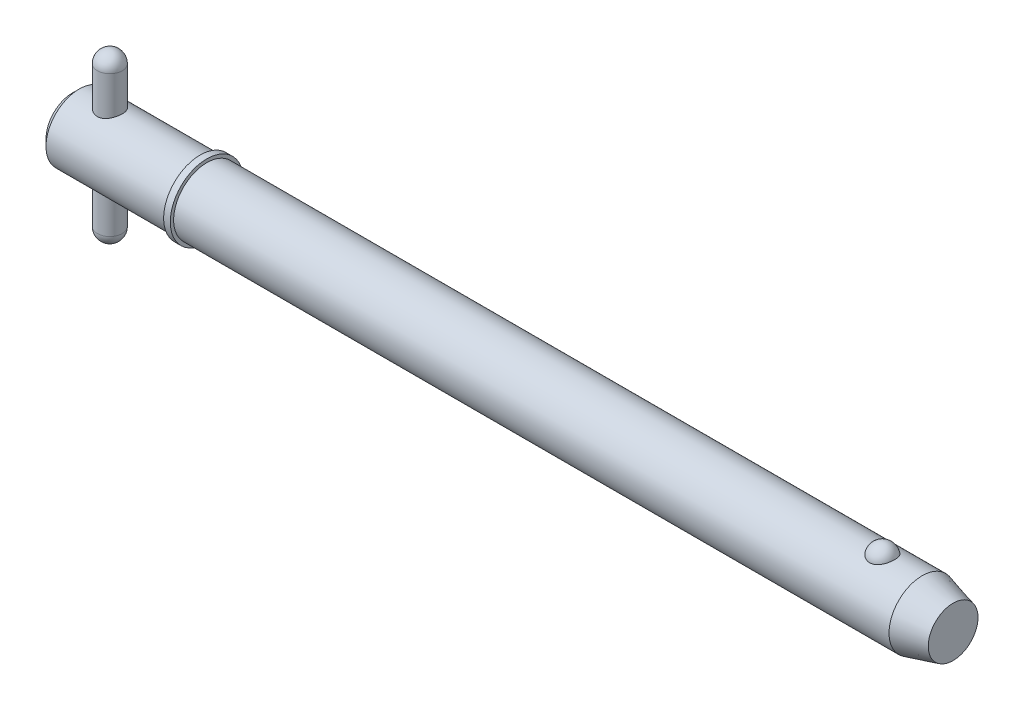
ISO-10303-21;
HEADER;
FILE_DESCRIPTION(('STEP AP214'),'2;1');
FILE_NAME('part.step','',(''),(''),'','','');
FILE_SCHEMA(('AUTOMOTIVE_DESIGN { 1 0 10303 214 1 1 1 1 }'));
ENDSEC;
DATA;
#1=APPLICATION_CONTEXT('core data for automotive mechanical design processes');
#2=APPLICATION_PROTOCOL_DEFINITION('international standard','automotive_design',2000,#1);
#3=PRODUCT_CONTEXT('',#1,'mechanical');
#4=PRODUCT('Part','Part','',(#3));
#5=PRODUCT_RELATED_PRODUCT_CATEGORY('part','',(#4));
#6=PRODUCT_DEFINITION_FORMATION('','',#4);
#7=PRODUCT_DEFINITION_CONTEXT('part definition',#1,'design');
#8=PRODUCT_DEFINITION('design','',#6,#7);
#9=PRODUCT_DEFINITION_SHAPE('','',#8);
#10=(LENGTH_UNIT() NAMED_UNIT(*) SI_UNIT(.MILLI.,.METRE.));
#11=(NAMED_UNIT(*) PLANE_ANGLE_UNIT() SI_UNIT($,.RADIAN.));
#12=(NAMED_UNIT(*) SI_UNIT($,.STERADIAN.) SOLID_ANGLE_UNIT());
#13=UNCERTAINTY_MEASURE_WITH_UNIT(LENGTH_MEASURE(1.E-05),#10,'distance_accuracy_value','');
#14=(GEOMETRIC_REPRESENTATION_CONTEXT(3) GLOBAL_UNCERTAINTY_ASSIGNED_CONTEXT((#13)) GLOBAL_UNIT_ASSIGNED_CONTEXT((#10,
#11,#12)) REPRESENTATION_CONTEXT('',''));
#15=CARTESIAN_POINT('',(0.,0.,0.));
#16=DIRECTION('',(0.,0.,1.));
#17=DIRECTION('',(1.,0.,0.));
#18=AXIS2_PLACEMENT_3D('',#15,#16,#17);
#19=CARTESIAN_POINT('',(7.14,15.875,0.));
#20=DIRECTION('',(0.,-1.,0.));
#21=DIRECTION('',(0.,0.,-1.));
#22=AXIS2_PLACEMENT_3D('',#19,#20,#21);
#23=CYLINDRICAL_SURFACE('',#22,2.38);
#24=CARTESIAN_POINT('',(7.14,-13.495,0.));
#25=DIRECTION('',(0.,-1.,0.));
#26=DIRECTION('',(0.,0.,-1.));
#27=AXIS2_PLACEMENT_3D('',#24,#25,#26);
#28=CIRCLE('',#27,2.38);
#29=CARTESIAN_POINT('',(7.14,-13.495,-2.38));
#30=VERTEX_POINT('',#29);
#31=EDGE_CURVE('P0_E10',#30,#30,#28,.F.);
#32=ORIENTED_EDGE('',*,*,#31,.T.);
#33=EDGE_LOOP('',(#32));
#34=FACE_BOUND('',#33,.T.);
#35=CARTESIAN_POINT('',(7.14,13.495,0.));
#36=DIRECTION('',(0.,-1.,0.));
#37=DIRECTION('',(0.,0.,-1.));
#38=AXIS2_PLACEMENT_3D('',#35,#36,#37);
#39=CIRCLE('',#38,2.38);
#40=CARTESIAN_POINT('',(7.14,13.495,-2.38));
#41=VERTEX_POINT('',#40);
#42=EDGE_CURVE('P0_E21',#41,#41,#39,.T.);
#43=ORIENTED_EDGE('',*,*,#42,.T.);
#44=EDGE_LOOP('',(#43));
#45=FACE_BOUND('',#44,.T.);
#46=ADVANCED_FACE('P0_F14',(#34,#45),#23,.T.);
#47=CARTESIAN_POINT('',(7.14,-13.495,0.));
#48=DIRECTION('',(0.,0.,1.));
#49=DIRECTION('',(1.,0.,0.));
#50=AXIS2_PLACEMENT_3D('',#47,#48,#49);
#51=SPHERICAL_SURFACE('',#50,2.38);
#52=CARTESIAN_POINT('',(7.14,-13.495,0.));
#53=DIRECTION('',(0.,-1.,0.));
#54=DIRECTION('',(0.,0.,-1.));
#55=AXIS2_PLACEMENT_3D('',#52,#53,#54);
#56=SPHERICAL_SURFACE('',#55,2.38);
#57=ORIENTED_EDGE('',*,*,#31,.F.);
#58=EDGE_LOOP('',(#57));
#59=FACE_BOUND('',#58,.T.);
#60=ADVANCED_FACE('P0_F29',(#59),#56,.T.);
#61=CARTESIAN_POINT('',(7.14,13.495,0.));
#62=DIRECTION('',(0.,0.,1.));
#63=DIRECTION('',(1.,0.,0.));
#64=AXIS2_PLACEMENT_3D('',#61,#62,#63);
#65=SPHERICAL_SURFACE('',#64,2.38);
#66=CARTESIAN_POINT('',(7.14,13.495,0.));
#67=DIRECTION('',(0.,-1.,0.));
#68=DIRECTION('',(0.,0.,-1.));
#69=AXIS2_PLACEMENT_3D('',#66,#67,#68);
#70=SPHERICAL_SURFACE('',#69,2.38);
#71=ORIENTED_EDGE('',*,*,#42,.F.);
#72=EDGE_LOOP('',(#71));
#73=FACE_BOUND('',#72,.T.);
#74=ADVANCED_FACE('P0_F16',(#73),#70,.T.);
#75=CLOSED_SHELL('',(#46,#60,#74));
#76=MANIFOLD_SOLID_BREP('P0_B1',#75);
#77=CARTESIAN_POINT('',(0.,0.,0.));
#78=DIRECTION('',(1.,0.,0.));
#79=DIRECTION('',(0.,0.,-1.));
#80=AXIS2_PLACEMENT_3D('',#77,#78,#79);
#81=CYLINDRICAL_SURFACE('',#80,6.35);
#82=CARTESIAN_POINT('',(162.655369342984,0.,0.));
#83=DIRECTION('',(1.,0.,0.));
#84=DIRECTION('',(0.,0.,-1.));
#85=AXIS2_PLACEMENT_3D('',#82,#83,#84);
#86=CIRCLE('',#85,6.35);
#87=CARTESIAN_POINT('',(162.655369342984,0.,-6.35));
#88=VERTEX_POINT('',#87);
#89=EDGE_CURVE('P1_E81',#88,#88,#86,.T.);
#90=ORIENTED_EDGE('',*,*,#89,.F.);
#91=EDGE_LOOP('',(#90));
#92=FACE_BOUND('',#91,.T.);
#93=CARTESIAN_POINT('',(25.7,0.,0.));
#94=DIRECTION('',(1.,0.,0.));
#95=DIRECTION('',(0.,0.,-1.));
#96=AXIS2_PLACEMENT_3D('',#93,#94,#95);
#97=CIRCLE('',#96,6.35);
#98=CARTESIAN_POINT('',(25.7,0.,-6.35));
#99=VERTEX_POINT('',#98);
#100=EDGE_CURVE('P1_E85',#99,#99,#97,.T.);
#101=ORIENTED_EDGE('',*,*,#100,.T.);
#102=EDGE_LOOP('',(#101));
#103=FACE_BOUND('',#102,.T.);
#104=CARTESIAN_POINT('',(155.030021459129,5.87502187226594,2.40969251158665));
#105=CARTESIAN_POINT('',(154.905030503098,5.87501645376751,2.40969773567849));
#106=CARTESIAN_POINT('',(154.780080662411,5.87916061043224,2.39967292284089));
#107=CARTESIAN_POINT('',(154.533909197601,5.89523112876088,2.35991730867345));
#108=CARTESIAN_POINT('',(154.412686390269,5.90715499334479,2.33019283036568));
#109=CARTESIAN_POINT('',(154.177517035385,5.93739567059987,2.25201402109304));
#110=CARTESIAN_POINT('',(154.063560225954,5.95570321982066,2.20358681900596));
#111=CARTESIAN_POINT('',(153.84557352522,5.99672067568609,2.08937987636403));
#112=CARTESIAN_POINT('',(153.741545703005,6.0194314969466,2.02359652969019));
#113=CARTESIAN_POINT('',(153.542943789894,6.06760647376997,1.87428969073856));
#114=CARTESIAN_POINT('',(153.448726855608,6.09313095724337,1.79031110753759));
#115=CARTESIAN_POINT('',(153.275255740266,6.14375873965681,1.6080017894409));
#116=CARTESIAN_POINT('',(153.196004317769,6.16886196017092,1.50966841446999));
#117=CARTESIAN_POINT('',(153.050845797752,6.21724600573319,1.29645884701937));
#118=CARTESIAN_POINT('',(152.985688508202,6.24039621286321,1.1810415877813));
#119=CARTESIAN_POINT('',(152.874703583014,6.28117277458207,0.940351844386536));
#120=CARTESIAN_POINT('',(152.828877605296,6.29879865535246,0.815078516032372));
#121=CARTESIAN_POINT('',(152.757023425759,6.32692073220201,0.556494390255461));
#122=CARTESIAN_POINT('',(152.731249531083,6.33732517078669,0.423102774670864));
#123=CARTESIAN_POINT('',(152.700988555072,6.34957673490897,0.153542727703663));
#124=CARTESIAN_POINT('',(152.696500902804,6.35142408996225,0.0173743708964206));
#125=CARTESIAN_POINT('',(152.708865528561,6.34638925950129,-0.253036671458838));
#126=CARTESIAN_POINT('',(152.725594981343,6.33955731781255,-0.387285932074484));
#127=CARTESIAN_POINT('',(152.779843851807,6.31794129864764,-0.650851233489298));
#128=CARTESIAN_POINT('',(152.817363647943,6.3031570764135,-0.780167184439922));
#129=CARTESIAN_POINT('',(152.912500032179,6.26711642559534,-1.03041949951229));
#130=CARTESIAN_POINT('',(152.970143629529,6.24585130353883,-1.15134433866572));
#131=CARTESIAN_POINT('',(153.104352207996,6.19905619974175,-1.38129800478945));
#132=CARTESIAN_POINT('',(153.180918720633,6.17352587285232,-1.49032586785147));
#133=CARTESIAN_POINT('',(153.351753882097,6.12080227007,-1.69393164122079));
#134=CARTESIAN_POINT('',(153.446100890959,6.09360200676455,-1.78844209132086));
#135=CARTESIAN_POINT('',(153.650119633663,6.04070434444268,-1.95970536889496));
#136=CARTESIAN_POINT('',(153.759790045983,6.015006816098,-2.0364597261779));
#137=CARTESIAN_POINT('',(153.989187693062,5.96867714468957,-2.16845644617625));
#138=CARTESIAN_POINT('',(154.108652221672,5.94794910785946,-2.22412062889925));
#139=CARTESIAN_POINT('',(154.356218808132,5.91340580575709,-2.31440992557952));
#140=CARTESIAN_POINT('',(154.484317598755,5.89958794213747,-2.34904294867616));
#141=CARTESIAN_POINT('',(154.738582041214,5.88111049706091,-2.39491590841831));
#142=CARTESIAN_POINT('',(154.864520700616,5.87602512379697,-2.40724512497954));
#143=CARTESIAN_POINT('',(155.116786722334,5.87428980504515,-2.41147867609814));
#144=CARTESIAN_POINT('',(155.243114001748,5.8776381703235,-2.40338710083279));
#145=CARTESIAN_POINT('',(155.488417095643,5.89212921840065,-2.36762715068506));
#146=CARTESIAN_POINT('',(155.607499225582,5.90302431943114,-2.3405803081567));
#147=CARTESIAN_POINT('',(155.83924472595,5.93113752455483,-2.26839066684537));
#148=CARTESIAN_POINT('',(155.951907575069,5.94835614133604,-2.22324640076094));
#149=CARTESIAN_POINT('',(156.170400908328,5.9877301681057,-2.11493806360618));
#150=CARTESIAN_POINT('',(156.276028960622,6.00998499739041,-2.05140269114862));
#151=CARTESIAN_POINT('',(156.475300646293,6.05690144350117,-1.90842705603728));
#152=CARTESIAN_POINT('',(156.568941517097,6.08156361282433,-1.82898313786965));
#153=CARTESIAN_POINT('',(156.746675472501,6.13211715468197,-1.65182429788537));
#154=CARTESIAN_POINT('',(156.830055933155,6.15800825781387,-1.5533938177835));
#155=CARTESIAN_POINT('',(156.979790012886,6.20712834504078,-1.34374214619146));
#156=CARTESIAN_POINT('',(157.046140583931,6.23035685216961,-1.23251867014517));
#157=CARTESIAN_POINT('',(157.162345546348,6.27251177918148,-0.996447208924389));
#158=CARTESIAN_POINT('',(157.211607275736,6.29127762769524,-0.871278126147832));
#159=CARTESIAN_POINT('',(157.289614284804,6.3215862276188,-0.613870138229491));
#160=CARTESIAN_POINT('',(157.318359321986,6.33312889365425,-0.481631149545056));
#161=CARTESIAN_POINT('',(157.354770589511,6.34782349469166,-0.213672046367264));
#162=CARTESIAN_POINT('',(157.362413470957,6.35096613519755,-0.0779482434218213));
#163=CARTESIAN_POINT('',(157.356395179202,6.34851322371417,0.192943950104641));
#164=CARTESIAN_POINT('',(157.342734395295,6.3429178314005,0.328112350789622));
#165=CARTESIAN_POINT('',(157.29450361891,6.32360512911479,0.593406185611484));
#166=CARTESIAN_POINT('',(157.260031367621,6.30992579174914,0.723552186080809));
#167=CARTESIAN_POINT('',(157.170953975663,6.27586325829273,0.97583417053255));
#168=CARTESIAN_POINT('',(157.11634761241,6.25547965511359,1.09796966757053));
#169=CARTESIAN_POINT('',(156.98775879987,6.20998183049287,1.33148921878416));
#170=CARTESIAN_POINT('',(156.913674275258,6.18484288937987,1.44281227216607));
#171=CARTESIAN_POINT('',(156.747820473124,6.13258735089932,1.65087683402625));
#172=CARTESIAN_POINT('',(156.656051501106,6.10547078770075,1.7476185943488));
#173=CARTESIAN_POINT('',(156.457183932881,6.05235879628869,1.92350926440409));
#174=CARTESIAN_POINT('',(156.350133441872,6.02636017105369,2.00271146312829));
#175=CARTESIAN_POINT('',(156.123138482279,5.97843747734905,2.14154159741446));
#176=CARTESIAN_POINT('',(156.003191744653,5.9565141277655,2.20116608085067));
#177=CARTESIAN_POINT('',(155.744523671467,5.91812106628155,2.30250570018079));
#178=CARTESIAN_POINT('',(155.60506980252,5.90217533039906,2.34256795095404));
#179=CARTESIAN_POINT('',(155.320397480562,5.88063128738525,2.3961521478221));
#180=CARTESIAN_POINT('',(155.17518174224,5.87502816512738,2.40968644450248));
#181=CARTESIAN_POINT('',(155.030021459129,5.87502187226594,2.40969251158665));
#182=B_SPLINE_CURVE_WITH_KNOTS('',3,(#104,#105,#106,#107,#108,#109,#110,#111,#112,#113,#114,
#115,#116,#117,#118,#119,#120,#121,#122,#123,#124,#125,#126,#127,#128,#129,#130,#131,#132,#133,
#134,#135,#136,#137,#138,#139,#140,#141,#142,#143,#144,#145,#146,#147,#148,#149,#150,#151,#152,
#153,#154,#155,#156,#157,#158,#159,#160,#161,#162,#163,#164,#165,#166,#167,#168,#169,#170,#171,
#172,#173,#174,#175,#176,#177,#178,#179,#180,#181),.UNSPECIFIED.,.T.,.F.,(4,2,2,2,2,2,2,2,2,2,2,
2,2,2,2,2,2,2,2,2,2,2,2,2,2,2,2,2,2,2,2,2,2,2,2,2,2,2,4),(0.,0.374440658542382,
0.748761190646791,1.122540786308,1.4963981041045,1.88098871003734,2.26565013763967,
2.66741104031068,3.06920639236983,3.47601794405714,3.88281858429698,4.28727498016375,
4.69173873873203,5.09674745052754,5.50178895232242,5.90865911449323,6.31549420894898,
6.71369855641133,7.11175305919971,7.48978077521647,7.86773278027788,8.23383886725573,
8.59997464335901,8.97409044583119,9.34829231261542,9.74122667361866,10.1342313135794,
10.5397522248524,10.9452779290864,11.3512521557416,11.75721896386,12.1612938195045,
12.5653932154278,12.9716540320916,13.3779078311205,13.7829098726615,14.1879832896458,
14.6230486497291,15.0579114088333),.UNSPECIFIED.);
#183=CARTESIAN_POINT('',(155.030021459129,5.87502187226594,2.40969251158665));
#184=VERTEX_POINT('',#183);
#185=EDGE_CURVE('P1_E35',#184,#184,#182,.T.);
#186=ORIENTED_EDGE('',*,*,#185,.T.);
#187=EDGE_LOOP('',(#186));
#188=FACE_BOUND('',#187,.T.);
#189=ADVANCED_FACE('P1_F13',(#92,#103,#188),#81,.T.);
#190=CARTESIAN_POINT('',(0.,0.,0.));
#191=DIRECTION('',(-1.,0.,0.));
#192=DIRECTION('',(0.,0.,1.));
#193=AXIS2_PLACEMENT_3D('',#190,#191,#192);
#194=PLANE('',#193);
#195=CARTESIAN_POINT('',(0.,0.,0.));
#196=DIRECTION('',(1.,0.,0.));
#197=DIRECTION('',(0.,0.,-1.));
#198=AXIS2_PLACEMENT_3D('',#195,#196,#197);
#199=CIRCLE('',#198,5.08);
#200=CARTESIAN_POINT('',(0.,0.,-5.08));
#201=VERTEX_POINT('',#200);
#202=EDGE_CURVE('P1_E9',#201,#201,#199,.T.);
#203=ORIENTED_EDGE('',*,*,#202,.F.);
#204=EDGE_LOOP('',(#203));
#205=FACE_BOUND('',#204,.T.);
#206=ADVANCED_FACE('P1_F15',(#205),#194,.T.);
#207=CARTESIAN_POINT('',(1.27,0.,0.));
#208=DIRECTION('',(1.,0.,0.));
#209=DIRECTION('',(0.,0.,-1.));
#210=AXIS2_PLACEMENT_3D('',#207,#208,#209);
#211=CONICAL_SURFACE('',#210,6.35,0.78539816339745);
#212=ORIENTED_EDGE('',*,*,#202,.T.);
#213=EDGE_LOOP('',(#212));
#214=FACE_BOUND('',#213,.T.);
#215=CARTESIAN_POINT('',(1.27,0.,0.));
#216=DIRECTION('',(1.,0.,0.));
#217=DIRECTION('',(0.,0.,-1.));
#218=AXIS2_PLACEMENT_3D('',#215,#216,#217);
#219=CIRCLE('',#218,6.35);
#220=CARTESIAN_POINT('',(1.27,0.,-6.35));
#221=VERTEX_POINT('',#220);
#222=EDGE_CURVE('P1_E26',#221,#221,#219,.T.);
#223=ORIENTED_EDGE('',*,*,#222,.F.);
#224=EDGE_LOOP('',(#223));
#225=FACE_BOUND('',#224,.T.);
#226=ADVANCED_FACE('P1_F77',(#214,#225),#211,.T.);
#227=CARTESIAN_POINT('',(0.,0.,0.));
#228=DIRECTION('',(1.,0.,0.));
#229=DIRECTION('',(0.,0.,-1.));
#230=AXIS2_PLACEMENT_3D('',#227,#228,#229);
#231=CYLINDRICAL_SURFACE('',#230,6.35);
#232=CARTESIAN_POINT('',(7.14,-5.88711304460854,2.38));
#233=CARTESIAN_POINT('',(7.01146258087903,-5.88710856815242,2.38000480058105));
#234=CARTESIAN_POINT('',(6.88295682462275,-5.89136840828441,2.36955244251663));
#235=CARTESIAN_POINT('',(6.62981934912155,-5.90782785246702,2.32820953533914));
#236=CARTESIAN_POINT('',(6.50518751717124,-5.92002722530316,2.29731958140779));
#237=CARTESIAN_POINT('',(6.26352403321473,-5.95079384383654,2.21639366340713));
#238=CARTESIAN_POINT('',(6.14647496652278,-5.96934583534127,2.16640353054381));
#239=CARTESIAN_POINT('',(5.92237941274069,-6.01070278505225,2.04885862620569));
#240=CARTESIAN_POINT('',(5.81533593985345,-6.03350901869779,1.98129858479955));
#241=CARTESIAN_POINT('',(5.60897525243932,-6.08207341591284,1.82693902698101));
#242=CARTESIAN_POINT('',(5.51022503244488,-6.10791836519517,1.73940861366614));
#243=CARTESIAN_POINT('',(5.32840561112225,-6.15892405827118,1.54914379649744));
#244=CARTESIAN_POINT('',(5.24533975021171,-6.1840846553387,1.44640616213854));
#245=CARTESIAN_POINT('',(5.09451639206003,-6.23191821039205,1.22434014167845));
#246=CARTESIAN_POINT('',(5.02737511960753,-6.25447755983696,1.10456656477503));
#247=CARTESIAN_POINT('',(4.91443001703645,-6.2935236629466,0.854429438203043));
#248=CARTESIAN_POINT('',(4.86861879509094,-6.31001251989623,0.724069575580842));
#249=CARTESIAN_POINT('',(4.80162253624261,-6.33444370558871,0.46242122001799));
#250=CARTESIAN_POINT('',(4.77946137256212,-6.34272370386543,0.331414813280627));
#251=CARTESIAN_POINT('',(4.75726677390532,-6.35101600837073,0.0672982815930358));
#252=CARTESIAN_POINT('',(4.75722615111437,-6.35103100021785,-0.0658111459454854));
#253=CARTESIAN_POINT('',(4.77870510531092,-6.3430064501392,-0.323358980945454));
#254=CARTESIAN_POINT('',(4.79915922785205,-6.33536494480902,-0.447900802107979));
#255=CARTESIAN_POINT('',(4.85925493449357,-6.31340794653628,-0.69163609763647));
#256=CARTESIAN_POINT('',(4.89889787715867,-6.29909198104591,-0.810829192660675));
#257=CARTESIAN_POINT('',(4.9967414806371,-6.26494471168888,-1.04254212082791));
#258=CARTESIAN_POINT('',(5.05520370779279,-6.24503620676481,-1.1549396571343));
#259=CARTESIAN_POINT('',(5.1887948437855,-6.20171869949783,-1.3686079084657));
#260=CARTESIAN_POINT('',(5.26392912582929,-6.17830856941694,-1.46987502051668));
#261=CARTESIAN_POINT('',(5.43386591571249,-6.12878580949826,-1.66468415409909));
#262=CARTESIAN_POINT('',(5.52956139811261,-6.10259519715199,-1.75742857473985));
#263=CARTESIAN_POINT('',(5.73530435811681,-6.05155777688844,-1.92585331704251));
#264=CARTESIAN_POINT('',(5.84535542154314,-6.02671130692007,-2.00152936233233));
#265=CARTESIAN_POINT('',(6.07982989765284,-5.98068420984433,-2.13519109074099));
#266=CARTESIAN_POINT('',(6.20451768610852,-5.95959698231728,-2.19274775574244));
#267=CARTESIAN_POINT('',(6.4628145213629,-5.92455622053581,-2.28574558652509));
#268=CARTESIAN_POINT('',(6.59641856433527,-5.91059872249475,-2.32119904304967));
#269=CARTESIAN_POINT('',(6.86087441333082,-5.8923327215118,-2.36717069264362));
#270=CARTESIAN_POINT('',(6.99147192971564,-5.8875347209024,-2.37895573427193));
#271=CARTESIAN_POINT('',(7.25283805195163,-5.88674545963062,-2.38091046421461));
#272=CARTESIAN_POINT('',(7.38360660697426,-5.89075200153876,-2.37108554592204));
#273=CARTESIAN_POINT('',(7.63510696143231,-5.90662331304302,-2.33124781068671));
#274=CARTESIAN_POINT('',(7.75602069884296,-5.91810660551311,-2.30221396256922));
#275=CARTESIAN_POINT('',(7.99120505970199,-5.94718527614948,-2.22601401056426));
#276=CARTESIAN_POINT('',(8.10547431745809,-5.96478190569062,-2.17884419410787));
#277=CARTESIAN_POINT('',(8.32888632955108,-6.00491533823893,-2.06572311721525));
#278=CARTESIAN_POINT('',(8.43767672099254,-6.02761250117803,-1.99913452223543));
#279=CARTESIAN_POINT('',(8.6429894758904,-6.07511988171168,-1.84974438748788));
#280=CARTESIAN_POINT('',(8.73950733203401,-6.09993087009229,-1.76693691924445));
#281=CARTESIAN_POINT('',(8.9238741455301,-6.1507686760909,-1.58125563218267));
#282=CARTESIAN_POINT('',(9.01078732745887,-6.17677301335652,-1.47744327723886));
#283=CARTESIAN_POINT('',(9.16607127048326,-6.22556172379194,-1.25606967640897));
#284=CARTESIAN_POINT('',(9.23444197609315,-6.24834608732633,-1.13850838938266));
#285=CARTESIAN_POINT('',(9.3502493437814,-6.28811144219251,-0.893050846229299));
#286=CARTESIAN_POINT('',(9.39775808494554,-6.30511236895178,-0.765192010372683));
#287=CARTESIAN_POINT('',(9.47032640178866,-6.33145833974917,-0.502514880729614));
#288=CARTESIAN_POINT('',(9.49539651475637,-6.34080697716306,-0.367699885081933));
#289=CARTESIAN_POINT('',(9.52124059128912,-6.35045496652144,-0.103396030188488));
#290=CARTESIAN_POINT('',(9.52334421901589,-6.35124952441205,0.025945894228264));
#291=CARTESIAN_POINT('',(9.50661518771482,-6.34499064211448,0.283061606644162));
#292=CARTESIAN_POINT('',(9.48778504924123,-6.33793814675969,0.410835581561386));
#293=CARTESIAN_POINT('',(9.43065630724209,-6.31700307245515,0.658028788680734));
#294=CARTESIAN_POINT('',(9.39284291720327,-6.30329098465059,0.7775756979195));
#295=CARTESIAN_POINT('',(9.29930406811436,-6.27046903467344,1.00863789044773));
#296=CARTESIAN_POINT('',(9.2435752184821,-6.25135815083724,1.12015164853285));
#297=CARTESIAN_POINT('',(9.11312349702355,-6.20865254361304,1.33711407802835));
#298=CARTESIAN_POINT('',(9.03770094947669,-6.18490316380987,1.44211105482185));
#299=CARTESIAN_POINT('',(8.87110640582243,-6.13583718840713,1.63836897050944));
#300=CARTESIAN_POINT('',(8.77992879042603,-6.11052003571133,1.72962498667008));
#301=CARTESIAN_POINT('',(8.57869799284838,-6.05953829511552,1.90076098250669));
#302=CARTESIAN_POINT('',(8.46790320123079,-6.03392573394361,1.97978778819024));
#303=CARTESIAN_POINT('',(8.23379693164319,-5.98676607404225,2.11813466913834));
#304=CARTESIAN_POINT('',(8.11048418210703,-5.9652193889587,2.17745273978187));
#305=CARTESIAN_POINT('',(7.84900037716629,-5.92818393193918,2.27641807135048));
#306=CARTESIAN_POINT('',(7.71041678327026,-5.91299857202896,2.31510015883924));
#307=CARTESIAN_POINT('',(7.42787316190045,-5.89246887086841,2.36688002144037));
#308=CARTESIAN_POINT('',(7.28391673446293,-5.88711805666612,2.37999462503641));
#309=CARTESIAN_POINT('',(7.14,-5.88711304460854,2.38));
#310=B_SPLINE_CURVE_WITH_KNOTS('',3,(#232,#233,#234,#235,#236,#237,#238,#239,#240,#241,#242,
#243,#244,#245,#246,#247,#248,#249,#250,#251,#252,#253,#254,#255,#256,#257,#258,#259,#260,#261,
#262,#263,#264,#265,#266,#267,#268,#269,#270,#271,#272,#273,#274,#275,#276,#277,#278,#279,#280,
#281,#282,#283,#284,#285,#286,#287,#288,#289,#290,#291,#292,#293,#294,#295,#296,#297,#298,#299,
#300,#301,#302,#303,#304,#305,#306,#307,#308,#309),.UNSPECIFIED.,.T.,.F.,(4,2,2,2,2,2,2,2,2,2,2,
2,2,2,2,2,2,2,2,2,2,2,2,2,2,2,2,2,2,2,2,2,2,2,2,2,2,2,4),(0.,0.385076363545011,
0.770141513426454,1.15428843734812,1.53855071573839,1.94016118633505,2.3418570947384,
2.75720522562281,3.1724093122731,3.569721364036,3.96690431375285,4.34445758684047,
4.72203759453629,5.10511017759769,5.48830640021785,5.89390240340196,6.29959991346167,
6.71428455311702,7.12873839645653,7.52034494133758,7.91185376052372,8.28480528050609,
8.65783318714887,9.0448340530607,9.43197664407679,9.84363087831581,10.2552863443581,
10.6655081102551,11.0755371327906,11.4616919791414,11.847800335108,12.224507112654,
12.6012852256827,12.9938941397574,13.386643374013,13.8000944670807,14.2135876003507,
14.6450218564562,15.0761720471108),.UNSPECIFIED.);
#311=CARTESIAN_POINT('',(7.14,-5.88711304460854,2.38));
#312=VERTEX_POINT('',#311);
#313=EDGE_CURVE('P1_E17',#312,#312,#310,.T.);
#314=ORIENTED_EDGE('',*,*,#313,.F.);
#315=EDGE_LOOP('',(#314));
#316=FACE_BOUND('',#315,.T.);
#317=CARTESIAN_POINT('',(7.14,5.88711304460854,2.38));
#318=CARTESIAN_POINT('',(7.26853741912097,5.88710856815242,2.38000480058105));
#319=CARTESIAN_POINT('',(7.39704317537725,5.89136840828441,2.36955244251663));
#320=CARTESIAN_POINT('',(7.65018065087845,5.90782785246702,2.32820953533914));
#321=CARTESIAN_POINT('',(7.77481248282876,5.92002722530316,2.29731958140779));
#322=CARTESIAN_POINT('',(8.01647596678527,5.95079384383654,2.21639366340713));
#323=CARTESIAN_POINT('',(8.13352503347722,5.96934583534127,2.16640353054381));
#324=CARTESIAN_POINT('',(8.35762058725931,6.01070278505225,2.04885862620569));
#325=CARTESIAN_POINT('',(8.46466406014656,6.03350901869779,1.98129858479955));
#326=CARTESIAN_POINT('',(8.67102474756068,6.08207341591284,1.82693902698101));
#327=CARTESIAN_POINT('',(8.76977496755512,6.10791836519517,1.73940861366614));
#328=CARTESIAN_POINT('',(8.95159438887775,6.15892405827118,1.54914379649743));
#329=CARTESIAN_POINT('',(9.03466024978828,6.1840846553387,1.44640616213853));
#330=CARTESIAN_POINT('',(9.18548360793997,6.23191821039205,1.22434014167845));
#331=CARTESIAN_POINT('',(9.25262488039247,6.25447755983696,1.10456656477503));
#332=CARTESIAN_POINT('',(9.36556998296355,6.2935236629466,0.854429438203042));
#333=CARTESIAN_POINT('',(9.41138120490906,6.31001251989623,0.72406957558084));
#334=CARTESIAN_POINT('',(9.47837746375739,6.33444370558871,0.462421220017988));
#335=CARTESIAN_POINT('',(9.50053862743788,6.34272370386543,0.331414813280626));
#336=CARTESIAN_POINT('',(9.52273322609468,6.35101600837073,0.0672982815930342));
#337=CARTESIAN_POINT('',(9.52277384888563,6.35103100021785,-0.0658111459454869));
#338=CARTESIAN_POINT('',(9.50129489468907,6.3430064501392,-0.323358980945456));
#339=CARTESIAN_POINT('',(9.48084077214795,6.33536494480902,-0.447900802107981));
#340=CARTESIAN_POINT('',(9.42074506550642,6.31340794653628,-0.691636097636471));
#341=CARTESIAN_POINT('',(9.38110212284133,6.29909198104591,-0.810829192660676));
#342=CARTESIAN_POINT('',(9.2832585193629,6.26494471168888,-1.04254212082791));
#343=CARTESIAN_POINT('',(9.22479629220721,6.24503620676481,-1.1549396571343));
#344=CARTESIAN_POINT('',(9.0912051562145,6.20171869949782,-1.3686079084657));
#345=CARTESIAN_POINT('',(9.0160708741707,6.17830856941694,-1.46987502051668));
#346=CARTESIAN_POINT('',(8.84613408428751,6.12878580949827,-1.66468415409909));
#347=CARTESIAN_POINT('',(8.75043860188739,6.10259519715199,-1.75742857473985));
#348=CARTESIAN_POINT('',(8.54469564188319,6.05155777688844,-1.92585331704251));
#349=CARTESIAN_POINT('',(8.43464457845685,6.02671130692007,-2.00152936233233));
#350=CARTESIAN_POINT('',(8.20017010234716,5.98068420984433,-2.13519109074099));
#351=CARTESIAN_POINT('',(8.07548231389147,5.95959698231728,-2.19274775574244));
#352=CARTESIAN_POINT('',(7.8171854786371,5.9245562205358,-2.28574558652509));
#353=CARTESIAN_POINT('',(7.68358143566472,5.91059872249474,-2.32119904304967));
#354=CARTESIAN_POINT('',(7.41912558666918,5.8923327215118,-2.36717069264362));
#355=CARTESIAN_POINT('',(7.28852807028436,5.8875347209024,-2.37895573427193));
#356=CARTESIAN_POINT('',(7.02716194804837,5.88674545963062,-2.38091046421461));
#357=CARTESIAN_POINT('',(6.89639339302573,5.89075200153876,-2.37108554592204));
#358=CARTESIAN_POINT('',(6.64489303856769,5.90662331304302,-2.33124781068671));
#359=CARTESIAN_POINT('',(6.52397930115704,5.91810660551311,-2.30221396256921));
#360=CARTESIAN_POINT('',(6.288794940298,5.94718527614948,-2.22601401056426));
#361=CARTESIAN_POINT('',(6.17452568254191,5.96478190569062,-2.17884419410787));
#362=CARTESIAN_POINT('',(5.95111367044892,6.00491533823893,-2.06572311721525));
#363=CARTESIAN_POINT('',(5.84232327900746,6.02761250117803,-1.99913452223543));
#364=CARTESIAN_POINT('',(5.6370105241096,6.07511988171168,-1.84974438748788));
#365=CARTESIAN_POINT('',(5.54049266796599,6.09993087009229,-1.76693691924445));
#366=CARTESIAN_POINT('',(5.3561258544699,6.1507686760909,-1.58125563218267));
#367=CARTESIAN_POINT('',(5.26921267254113,6.17677301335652,-1.47744327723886));
#368=CARTESIAN_POINT('',(5.11392872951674,6.22556172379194,-1.25606967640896));
#369=CARTESIAN_POINT('',(5.04555802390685,6.24834608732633,-1.13850838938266));
#370=CARTESIAN_POINT('',(4.9297506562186,6.28811144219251,-0.893050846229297));
#371=CARTESIAN_POINT('',(4.88224191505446,6.30511236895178,-0.76519201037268));
#372=CARTESIAN_POINT('',(4.80967359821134,6.33145833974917,-0.502514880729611));
#373=CARTESIAN_POINT('',(4.78460348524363,6.34080697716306,-0.36769988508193));
#374=CARTESIAN_POINT('',(4.75875940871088,6.35045496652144,-0.103396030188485));
#375=CARTESIAN_POINT('',(4.75665578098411,6.35124952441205,0.025945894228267));
#376=CARTESIAN_POINT('',(4.77338481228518,6.34499064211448,0.283061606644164));
#377=CARTESIAN_POINT('',(4.79221495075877,6.33793814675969,0.410835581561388));
#378=CARTESIAN_POINT('',(4.84934369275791,6.31700307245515,0.658028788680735));
#379=CARTESIAN_POINT('',(4.88715708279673,6.30329098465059,0.777575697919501));
#380=CARTESIAN_POINT('',(4.98069593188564,6.27046903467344,1.00863789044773));
#381=CARTESIAN_POINT('',(5.0364247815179,6.25135815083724,1.12015164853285));
#382=CARTESIAN_POINT('',(5.16687650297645,6.20865254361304,1.33711407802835));
#383=CARTESIAN_POINT('',(5.24229905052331,6.18490316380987,1.44211105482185));
#384=CARTESIAN_POINT('',(5.40889359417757,6.13583718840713,1.63836897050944));
#385=CARTESIAN_POINT('',(5.50007120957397,6.11052003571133,1.72962498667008));
#386=CARTESIAN_POINT('',(5.70130200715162,6.05953829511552,1.90076098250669));
#387=CARTESIAN_POINT('',(5.81209679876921,6.03392573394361,1.97978778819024));
#388=CARTESIAN_POINT('',(6.04620306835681,5.98676607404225,2.11813466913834));
#389=CARTESIAN_POINT('',(6.16951581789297,5.9652193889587,2.17745273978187));
#390=CARTESIAN_POINT('',(6.43099962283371,5.92818393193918,2.27641807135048));
#391=CARTESIAN_POINT('',(6.56958321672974,5.91299857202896,2.31510015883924));
#392=CARTESIAN_POINT('',(6.85212683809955,5.89246887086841,2.36688002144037));
#393=CARTESIAN_POINT('',(6.99608326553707,5.88711805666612,2.37999462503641));
#394=CARTESIAN_POINT('',(7.14,5.88711304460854,2.38));
#395=B_SPLINE_CURVE_WITH_KNOTS('',3,(#317,#318,#319,#320,#321,#322,#323,#324,#325,#326,#327,
#328,#329,#330,#331,#332,#333,#334,#335,#336,#337,#338,#339,#340,#341,#342,#343,#344,#345,#346,
#347,#348,#349,#350,#351,#352,#353,#354,#355,#356,#357,#358,#359,#360,#361,#362,#363,#364,#365,
#366,#367,#368,#369,#370,#371,#372,#373,#374,#375,#376,#377,#378,#379,#380,#381,#382,#383,#384,
#385,#386,#387,#388,#389,#390,#391,#392,#393,#394),.UNSPECIFIED.,.T.,.F.,(4,2,2,2,2,2,2,2,2,2,2,
2,2,2,2,2,2,2,2,2,2,2,2,2,2,2,2,2,2,2,2,2,2,2,2,2,2,2,4),(0.,0.385076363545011,
0.770141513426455,1.15428843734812,1.53855071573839,1.94016118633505,2.3418570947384,
2.75720522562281,3.1724093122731,3.56972136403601,3.96690431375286,4.34445758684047,
4.72203759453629,5.10511017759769,5.48830640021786,5.89390240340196,6.29959991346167,
6.71428455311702,7.12873839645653,7.52034494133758,7.91185376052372,8.2848052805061,
8.65783318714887,9.0448340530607,9.43197664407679,9.84363087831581,10.2552863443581,
10.6655081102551,11.0755371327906,11.4616919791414,11.847800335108,12.2245071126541,
12.6012852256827,12.9938941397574,13.386643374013,13.8000944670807,14.2135876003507,
14.6450218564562,15.0761720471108),.UNSPECIFIED.);
#396=CARTESIAN_POINT('',(7.14,5.88711304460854,2.38));
#397=VERTEX_POINT('',#396);
#398=EDGE_CURVE('P1_E43',#397,#397,#395,.T.);
#399=ORIENTED_EDGE('',*,*,#398,.F.);
#400=EDGE_LOOP('',(#399));
#401=FACE_BOUND('',#400,.T.);
#402=ORIENTED_EDGE('',*,*,#222,.T.);
#403=EDGE_LOOP('',(#402));
#404=FACE_BOUND('',#403,.T.);
#405=CARTESIAN_POINT('',(24.43,0.,0.));
#406=DIRECTION('',(1.,0.,0.));
#407=DIRECTION('',(0.,0.,-1.));
#408=AXIS2_PLACEMENT_3D('',#405,#406,#407);
#409=CIRCLE('',#408,6.35);
#410=CARTESIAN_POINT('',(24.43,0.,-6.35));
#411=VERTEX_POINT('',#410);
#412=EDGE_CURVE('P1_E31',#411,#411,#409,.T.);
#413=ORIENTED_EDGE('',*,*,#412,.F.);
#414=EDGE_LOOP('',(#413));
#415=FACE_BOUND('',#414,.T.);
#416=ADVANCED_FACE('P1_F103',(#316,#401,#404,#415),#231,.T.);
#417=CARTESIAN_POINT('',(24.43,6.35,0.));
#418=DIRECTION('',(-1.,0.,0.));
#419=DIRECTION('',(0.,0.,1.));
#420=AXIS2_PLACEMENT_3D('',#417,#418,#419);
#421=PLANE('',#420);
#422=ORIENTED_EDGE('',*,*,#412,.T.);
#423=EDGE_LOOP('',(#422));
#424=FACE_BOUND('',#423,.T.);
#425=CARTESIAN_POINT('',(24.43,0.,0.));
#426=DIRECTION('',(1.,0.,0.));
#427=DIRECTION('',(0.,0.,-1.));
#428=AXIS2_PLACEMENT_3D('',#425,#426,#427);
#429=CIRCLE('',#428,6.985);
#430=CARTESIAN_POINT('',(24.43,0.,-6.985));
#431=VERTEX_POINT('',#430);
#432=EDGE_CURVE('P1_E91',#431,#431,#429,.T.);
#433=ORIENTED_EDGE('',*,*,#432,.F.);
#434=EDGE_LOOP('',(#433));
#435=FACE_BOUND('',#434,.T.);
#436=ADVANCED_FACE('P1_F100',(#424,#435),#421,.T.);
#437=CARTESIAN_POINT('',(0.,0.,0.));
#438=DIRECTION('',(1.,0.,0.));
#439=DIRECTION('',(0.,0.,-1.));
#440=AXIS2_PLACEMENT_3D('',#437,#438,#439);
#441=CYLINDRICAL_SURFACE('',#440,6.985);
#442=ORIENTED_EDGE('',*,*,#432,.T.);
#443=EDGE_LOOP('',(#442));
#444=FACE_BOUND('',#443,.T.);
#445=CARTESIAN_POINT('',(25.7,0.,0.));
#446=DIRECTION('',(1.,0.,0.));
#447=DIRECTION('',(0.,0.,-1.));
#448=AXIS2_PLACEMENT_3D('',#445,#446,#447);
#449=CIRCLE('',#448,6.985);
#450=CARTESIAN_POINT('',(25.7,0.,-6.985));
#451=VERTEX_POINT('',#450);
#452=EDGE_CURVE('P1_E88',#451,#451,#449,.T.);
#453=ORIENTED_EDGE('',*,*,#452,.F.);
#454=EDGE_LOOP('',(#453));
#455=FACE_BOUND('',#454,.T.);
#456=ADVANCED_FACE('P1_F68',(#444,#455),#441,.T.);
#457=CARTESIAN_POINT('',(25.7,6.985,0.));
#458=DIRECTION('',(1.,0.,0.));
#459=DIRECTION('',(0.,0.,-1.));
#460=AXIS2_PLACEMENT_3D('',#457,#458,#459);
#461=PLANE('',#460);
#462=ORIENTED_EDGE('',*,*,#452,.T.);
#463=EDGE_LOOP('',(#462));
#464=FACE_BOUND('',#463,.T.);
#465=ORIENTED_EDGE('',*,*,#100,.F.);
#466=EDGE_LOOP('',(#465));
#467=FACE_BOUND('',#466,.T.);
#468=ADVANCED_FACE('P1_F62',(#464,#467),#461,.T.);
#469=CARTESIAN_POINT('',(168.58,0.,0.));
#470=DIRECTION('',(-1.,0.,0.));
#471=DIRECTION('',(0.,0.,1.));
#472=AXIS2_PLACEMENT_3D('',#469,#470,#471);
#473=CONICAL_SURFACE('',#472,4.76250000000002,0.26179938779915);
#474=ORIENTED_EDGE('',*,*,#89,.T.);
#475=EDGE_LOOP('',(#474));
#476=FACE_BOUND('',#475,.T.);
#477=CARTESIAN_POINT('',(168.58,0.,0.));
#478=DIRECTION('',(1.,0.,0.));
#479=DIRECTION('',(0.,0.,-1.));
#480=AXIS2_PLACEMENT_3D('',#477,#478,#479);
#481=CIRCLE('',#480,4.76250000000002);
#482=CARTESIAN_POINT('',(168.58,0.,-4.76250000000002));
#483=VERTEX_POINT('',#482);
#484=EDGE_CURVE('P1_E42',#483,#483,#481,.T.);
#485=ORIENTED_EDGE('',*,*,#484,.F.);
#486=EDGE_LOOP('',(#485));
#487=FACE_BOUND('',#486,.T.);
#488=ADVANCED_FACE('P1_F59',(#476,#487),#473,.T.);
#489=CARTESIAN_POINT('',(168.58,4.76250000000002,0.));
#490=DIRECTION('',(1.,0.,0.));
#491=DIRECTION('',(0.,0.,-1.));
#492=AXIS2_PLACEMENT_3D('',#489,#490,#491);
#493=PLANE('',#492);
#494=ORIENTED_EDGE('',*,*,#484,.T.);
#495=EDGE_LOOP('',(#494));
#496=FACE_BOUND('',#495,.T.);
#497=ADVANCED_FACE('P1_F55',(#496),#493,.T.);
#498=CARTESIAN_POINT('',(155.030021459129,5.715,0.));
#499=DIRECTION('',(-1.,0.,0.));
#500=DIRECTION('',(0.,1.,0.));
#501=AXIS2_PLACEMENT_3D('',#498,#499,#500);
#502=SPHERICAL_SURFACE('',#501,2.41500000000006);
#503=ORIENTED_EDGE('',*,*,#185,.F.);
#504=EDGE_LOOP('',(#503));
#505=FACE_BOUND('',#504,.T.);
#506=ADVANCED_FACE('P1_F50',(#505),#502,.T.);
#507=CARTESIAN_POINT('',(7.14,-6.985,0.));
#508=DIRECTION('',(0.,1.,0.));
#509=DIRECTION('',(0.,0.,1.));
#510=AXIS2_PLACEMENT_3D('',#507,#508,#509);
#511=CYLINDRICAL_SURFACE('',#510,2.38);
#512=ORIENTED_EDGE('',*,*,#313,.T.);
#513=EDGE_LOOP('',(#512));
#514=FACE_BOUND('',#513,.T.);
#515=ORIENTED_EDGE('',*,*,#398,.T.);
#516=EDGE_LOOP('',(#515));
#517=FACE_BOUND('',#516,.T.);
#518=ADVANCED_FACE('P1_F54',(#514,#517),#511,.F.);
#519=CLOSED_SHELL('',(#189,#206,#226,#416,#436,#456,#468,#488,#497,#506,#518));
#520=MANIFOLD_SOLID_BREP('P1_B1',#519);
#521=ADVANCED_BREP_SHAPE_REPRESENTATION('',(#18,#76,#520),#14);
#522=SHAPE_DEFINITION_REPRESENTATION(#9,#521);
ENDSEC;
END-ISO-10303-21;
